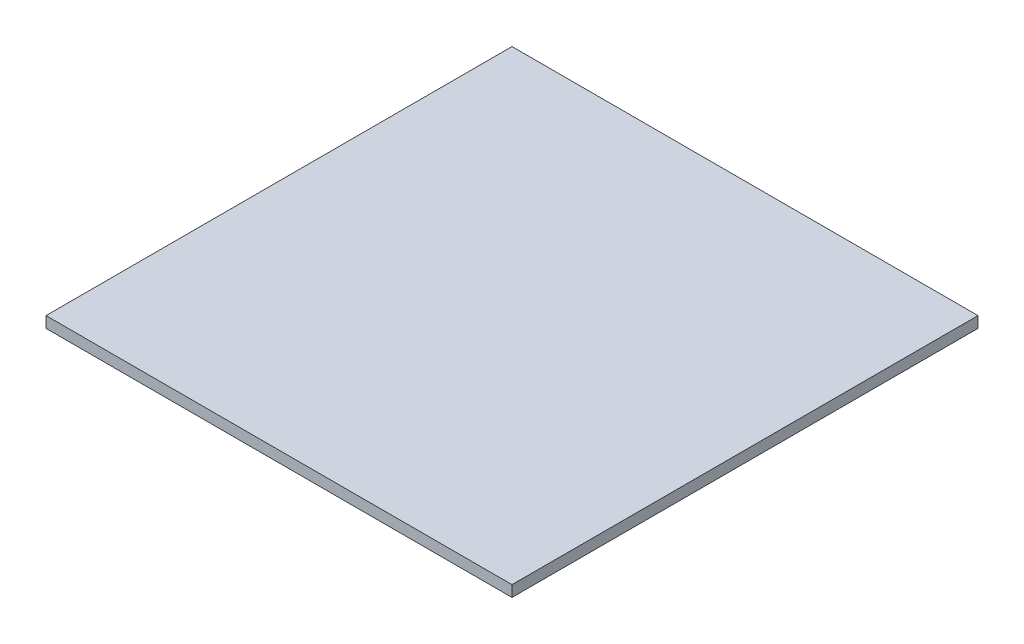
from build123d import *

# Parameters (mm, degrees)
SKETCH1_W           = 266.7
SKETCH1_H           = 266.7
BOSS_EXTRUDE1_DEPTH = 6.35


with BuildPart() as part:
    # Sketch1 → Boss-Extrude1 (new body)
    with BuildSketch(Plane(origin=(0, 0, 0), x_dir=(1, 0, 0), z_dir=(0, 1, 0))):
        Rectangle(SKETCH1_W, SKETCH1_H)
    extrude(amount=BOSS_EXTRUDE1_DEPTH)


solid = part.part
